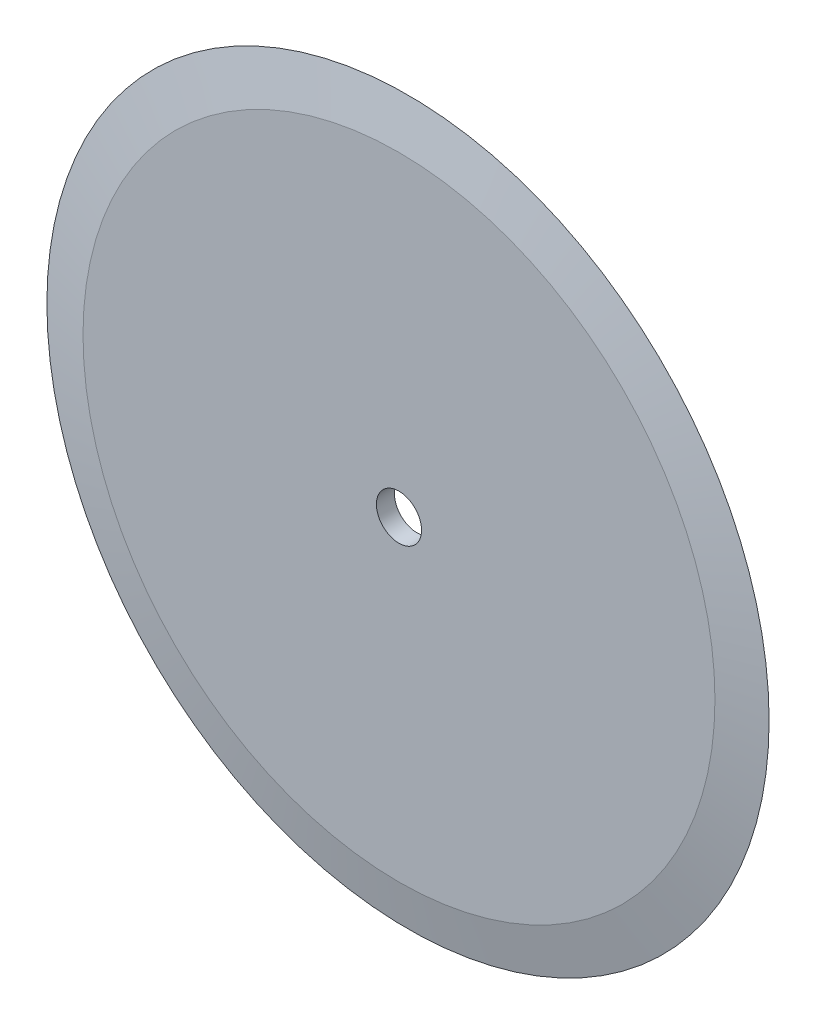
ISO-10303-21;
HEADER;
FILE_DESCRIPTION(('STEP AP214'),'2;1');
FILE_NAME('part.step','',(''),(''),'','','');
FILE_SCHEMA(('AUTOMOTIVE_DESIGN { 1 0 10303 214 1 1 1 1 }'));
ENDSEC;
DATA;
#1=APPLICATION_CONTEXT('core data for automotive mechanical design processes');
#2=APPLICATION_PROTOCOL_DEFINITION('international standard','automotive_design',2000,#1);
#3=PRODUCT_CONTEXT('',#1,'mechanical');
#4=PRODUCT('Part','Part','',(#3));
#5=PRODUCT_RELATED_PRODUCT_CATEGORY('part','',(#4));
#6=PRODUCT_DEFINITION_FORMATION('','',#4);
#7=PRODUCT_DEFINITION_CONTEXT('part definition',#1,'design');
#8=PRODUCT_DEFINITION('design','',#6,#7);
#9=PRODUCT_DEFINITION_SHAPE('','',#8);
#10=(LENGTH_UNIT() NAMED_UNIT(*) SI_UNIT(.MILLI.,.METRE.));
#11=(NAMED_UNIT(*) PLANE_ANGLE_UNIT() SI_UNIT($,.RADIAN.));
#12=(NAMED_UNIT(*) SI_UNIT($,.STERADIAN.) SOLID_ANGLE_UNIT());
#13=UNCERTAINTY_MEASURE_WITH_UNIT(LENGTH_MEASURE(1.E-05),#10,'distance_accuracy_value','');
#14=(GEOMETRIC_REPRESENTATION_CONTEXT(3) GLOBAL_UNCERTAINTY_ASSIGNED_CONTEXT((#13)) GLOBAL_UNIT_ASSIGNED_CONTEXT((#10,
#11,#12)) REPRESENTATION_CONTEXT('',''));
#15=CARTESIAN_POINT('',(0.,0.,0.));
#16=DIRECTION('',(0.,0.,1.));
#17=DIRECTION('',(1.,0.,0.));
#18=AXIS2_PLACEMENT_3D('',#15,#16,#17);
#19=CARTESIAN_POINT('',(0.,0.,1.));
#20=DIRECTION('',(0.,0.,1.));
#21=DIRECTION('',(1.,0.,0.));
#22=AXIS2_PLACEMENT_3D('',#19,#20,#21);
#23=PLANE('',#22);
#24=CARTESIAN_POINT('',(0.,0.,1.));
#25=DIRECTION('',(0.,0.,1.));
#26=DIRECTION('',(1.,0.,0.));
#27=AXIS2_PLACEMENT_3D('',#24,#25,#26);
#28=CIRCLE('',#27,34.9999999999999);
#29=CARTESIAN_POINT('',(34.9999999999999,0.,1.));
#30=VERTEX_POINT('',#29);
#31=EDGE_CURVE('E10',#30,#30,#28,.T.);
#32=ORIENTED_EDGE('',*,*,#31,.T.);
#33=EDGE_LOOP('',(#32));
#34=FACE_BOUND('',#33,.T.);
#35=CARTESIAN_POINT('',(0.,0.,1.));
#36=DIRECTION('',(0.,0.,1.));
#37=DIRECTION('',(1.,0.,0.));
#38=AXIS2_PLACEMENT_3D('',#35,#36,#37);
#39=CIRCLE('',#38,2.5);
#40=CARTESIAN_POINT('',(2.5,0.,1.));
#41=VERTEX_POINT('',#40);
#42=EDGE_CURVE('E42',#41,#41,#39,.T.);
#43=ORIENTED_EDGE('',*,*,#42,.F.);
#44=EDGE_LOOP('',(#43));
#45=FACE_BOUND('',#44,.T.);
#46=ADVANCED_FACE('F30',(#34,#45),#23,.T.);
#47=CARTESIAN_POINT('',(0.,0.,-1.));
#48=DIRECTION('',(0.,0.,1.));
#49=DIRECTION('',(1.,0.,0.));
#50=AXIS2_PLACEMENT_3D('',#47,#48,#49);
#51=PLANE('',#50);
#52=CARTESIAN_POINT('',(0.,0.,-1.));
#53=DIRECTION('',(0.,0.,1.));
#54=DIRECTION('',(1.,0.,0.));
#55=AXIS2_PLACEMENT_3D('',#52,#53,#54);
#56=CIRCLE('',#55,35.);
#57=CARTESIAN_POINT('',(35.,0.,-1.));
#58=VERTEX_POINT('',#57);
#59=EDGE_CURVE('E38',#58,#58,#56,.F.);
#60=ORIENTED_EDGE('',*,*,#59,.T.);
#61=EDGE_LOOP('',(#60));
#62=FACE_BOUND('',#61,.T.);
#63=CARTESIAN_POINT('',(0.,0.,-1.));
#64=DIRECTION('',(0.,0.,1.));
#65=DIRECTION('',(1.,0.,0.));
#66=AXIS2_PLACEMENT_3D('',#63,#64,#65);
#67=CIRCLE('',#66,2.5);
#68=CARTESIAN_POINT('',(2.5,0.,-1.));
#69=VERTEX_POINT('',#68);
#70=EDGE_CURVE('E45',#69,#69,#67,.T.);
#71=ORIENTED_EDGE('',*,*,#70,.T.);
#72=EDGE_LOOP('',(#71));
#73=FACE_BOUND('',#72,.T.);
#74=ADVANCED_FACE('F55',(#62,#73),#51,.F.);
#75=CARTESIAN_POINT('',(0.,0.,1.));
#76=DIRECTION('',(0.,0.,-1.));
#77=DIRECTION('',(-1.,0.,0.));
#78=AXIS2_PLACEMENT_3D('',#75,#76,#77);
#79=CYLINDRICAL_SURFACE('',#78,2.5);
#80=ORIENTED_EDGE('',*,*,#42,.T.);
#81=EDGE_LOOP('',(#80));
#82=FACE_BOUND('',#81,.T.);
#83=ORIENTED_EDGE('',*,*,#70,.F.);
#84=EDGE_LOOP('',(#83));
#85=FACE_BOUND('',#84,.T.);
#86=ADVANCED_FACE('F51',(#82,#85),#79,.F.);
#87=CARTESIAN_POINT('',(0.,0.,1.));
#88=DIRECTION('',(0.,0.,-1.));
#89=DIRECTION('',(-1.,0.,0.));
#90=AXIS2_PLACEMENT_3D('',#87,#88,#89);
#91=CONICAL_SURFACE('',#90,34.9999999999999,1.37340076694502);
#92=ORIENTED_EDGE('',*,*,#31,.F.);
#93=EDGE_LOOP('',(#92));
#94=FACE_BOUND('',#93,.T.);
#95=CARTESIAN_POINT('',(0.,0.,0.));
#96=DIRECTION('',(0.,0.,1.));
#97=DIRECTION('',(1.,0.,0.));
#98=AXIS2_PLACEMENT_3D('',#95,#96,#97);
#99=CIRCLE('',#98,40.);
#100=CARTESIAN_POINT('',(40.,0.,0.));
#101=VERTEX_POINT('',#100);
#102=EDGE_CURVE('E34',#101,#101,#99,.F.);
#103=ORIENTED_EDGE('',*,*,#102,.F.);
#104=EDGE_LOOP('',(#103));
#105=FACE_BOUND('',#104,.T.);
#106=ADVANCED_FACE('F32',(#94,#105),#91,.T.);
#107=CARTESIAN_POINT('',(0.,0.,0.));
#108=DIRECTION('',(0.,0.,1.));
#109=DIRECTION('',(1.,0.,0.));
#110=AXIS2_PLACEMENT_3D('',#107,#108,#109);
#111=CONICAL_SURFACE('',#110,40.,1.37340076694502);
#112=ORIENTED_EDGE('',*,*,#59,.F.);
#113=EDGE_LOOP('',(#112));
#114=FACE_BOUND('',#113,.T.);
#115=ORIENTED_EDGE('',*,*,#102,.T.);
#116=EDGE_LOOP('',(#115));
#117=FACE_BOUND('',#116,.T.);
#118=ADVANCED_FACE('F63',(#114,#117),#111,.T.);
#119=CLOSED_SHELL('',(#46,#74,#86,#106,#118));
#120=MANIFOLD_SOLID_BREP('B2',#119);
#121=ADVANCED_BREP_SHAPE_REPRESENTATION('',(#18,#120),#14);
#122=SHAPE_DEFINITION_REPRESENTATION(#9,#121);
ENDSEC;
END-ISO-10303-21;
